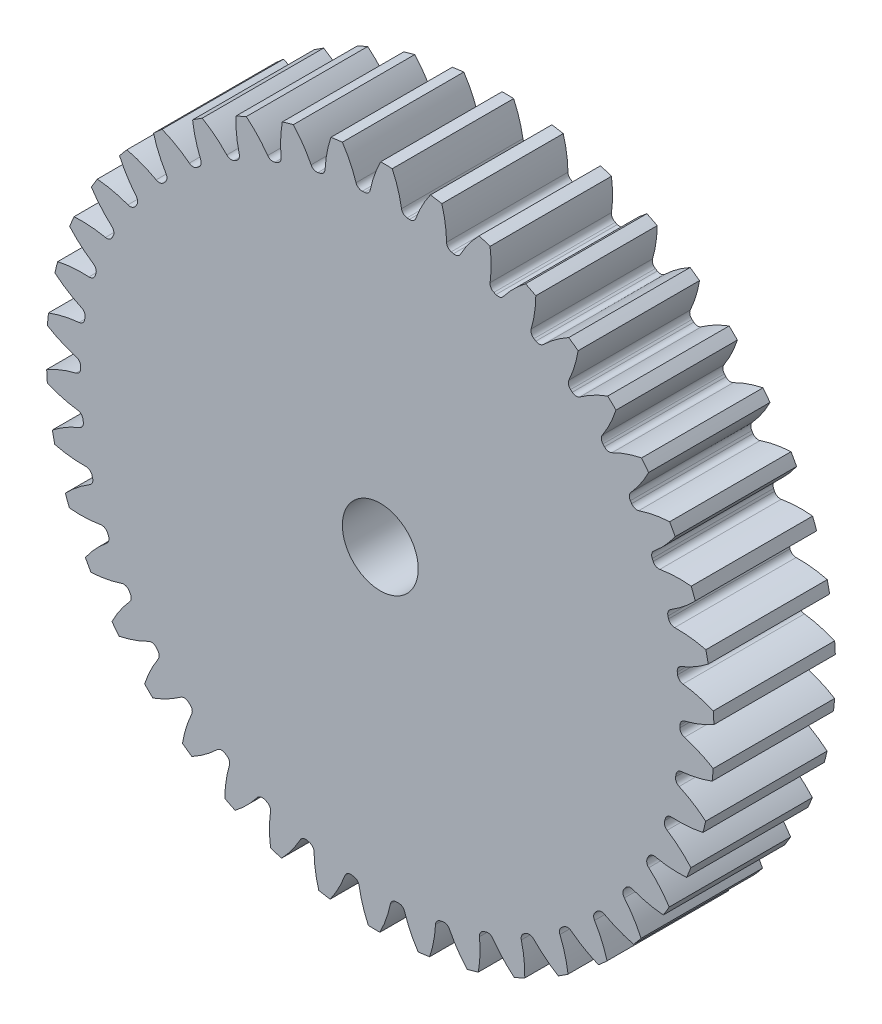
from build123d import *

# Parameters (mm, degrees)
SKETCH3_R         = 279.4
GEARBODY_DEPTH    = 101.6
TOOTHCUT_DEPTH    = 408.984411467
CIRPATTERN1_COUNT = 42
BOREDIA_R         = 31.75
BORE_DEPTH        = 12700


with BuildPart() as part:
    # Sketch3 → gearBody (new body)
    with BuildSketch(Plane.XY):
        Circle(SKETCH3_R)
    extrude(amount=GEARBODY_DEPTH)

    # Sketch2 → toothCut (cut, through all)
    with BuildSketch(Plane.XY):
        with BuildLine():
            ThreePointArc((250.762566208, -5.596071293), (250.782037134, -4.642249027), (250.797880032, -3.688359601))
            ThreePointArc((250.797880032, -3.688359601), (251.923020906, -0.54411023), (254.735846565, 1.255961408))
            ThreePointArc((254.735846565, 1.255961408), (267.401601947, 5.293625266), (279.4, 11.017481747))
            ThreePointArc((279.4, 11.017481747), (279.569245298, -5.175131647), (278.800835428, -21.350388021))
            ThreePointArc((278.800835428, -21.350388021), (267.022494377, -15.186398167), (254.514848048, -10.682747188))
            ThreePointArc((254.514848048, -10.682747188), (251.770569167, -8.779807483), (250.762566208, -5.596071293))
        make_face()
    toothcut = extrude(amount=TOOTHCUT_DEPTH, mode=Mode.SUBTRACT)

    # CirPattern1: toothCut ×42 about axis
    cirpattern1_axis = Axis((0, 0, 0), (0, 0, 1))
    for i in range(1, CIRPATTERN1_COUNT):
        add(toothcut.rotate(cirpattern1_axis, i * 360 / CIRPATTERN1_COUNT), mode=Mode.SUBTRACT)

    # boreDia → bore (cut, symmetric)
    with BuildSketch(Plane.XY):
        Circle(BOREDIA_R)
    extrude(amount=BORE_DEPTH, both=True, mode=Mode.SUBTRACT)


solid = part.part
